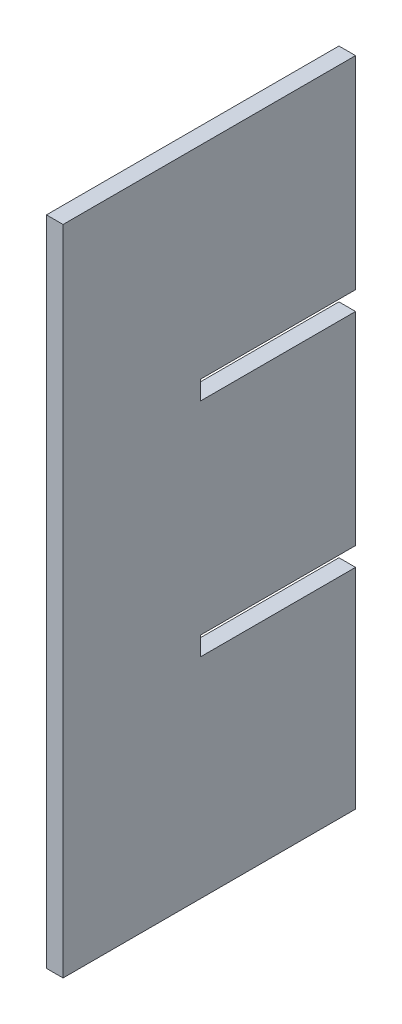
from build123d import *

# Parameters (mm, degrees)
CROQUIS16_W             = 1.5
CROQUIS16_H             = 79.5
SALIENTE_EXTRUIR9_DEPTH = 26.4
CROQUIS20_W             = 14
CROQUIS20_H             = 1.7
CORTAR_EXTRUIR2_DEPTH   = 1.5
CROQUIS21_W             = 26.4
CROQUIS21_H             = 20.6
CORTAR_EXTRUIR3_DEPTH   = 1.5


with BuildPart() as part:
    # Croquis16 → Saliente-Extruir9 (new body)
    with BuildSketch(Plane.XY):
        with Locations((-17.5, 0)):
            Rectangle(CROQUIS16_W, CROQUIS16_H)
    extrude(amount=SALIENTE_EXTRUIR9_DEPTH)

    # Croquis20 → Cortar-Extruir2 (cut)
    with BuildSketch(Plane(origin=(-16.75, 0, 0), x_dir=(0, 0, -1), z_dir=(1, 0, 0))):
        with Locations((-7, -20)):
            Rectangle(CROQUIS20_W, CROQUIS20_H)
        with Locations((-7, 0)):
            Rectangle(CROQUIS20_W, CROQUIS20_H)
        with Locations((-7, 20)):
            Rectangle(CROQUIS20_W, CROQUIS20_H)
    extrude(amount=-CORTAR_EXTRUIR2_DEPTH, mode=Mode.SUBTRACT)

    # Croquis21 → Cortar-Extruir3 (cut)
    with BuildSketch(Plane(origin=(-16.75, 0, 0), x_dir=(0, 0, -1), z_dir=(1, 0, 0))):
        with Locations((-13.2, 29.45)):
            Rectangle(CROQUIS21_W, CROQUIS21_H)
    extrude(amount=-CORTAR_EXTRUIR3_DEPTH, mode=Mode.SUBTRACT)


solid = part.part
